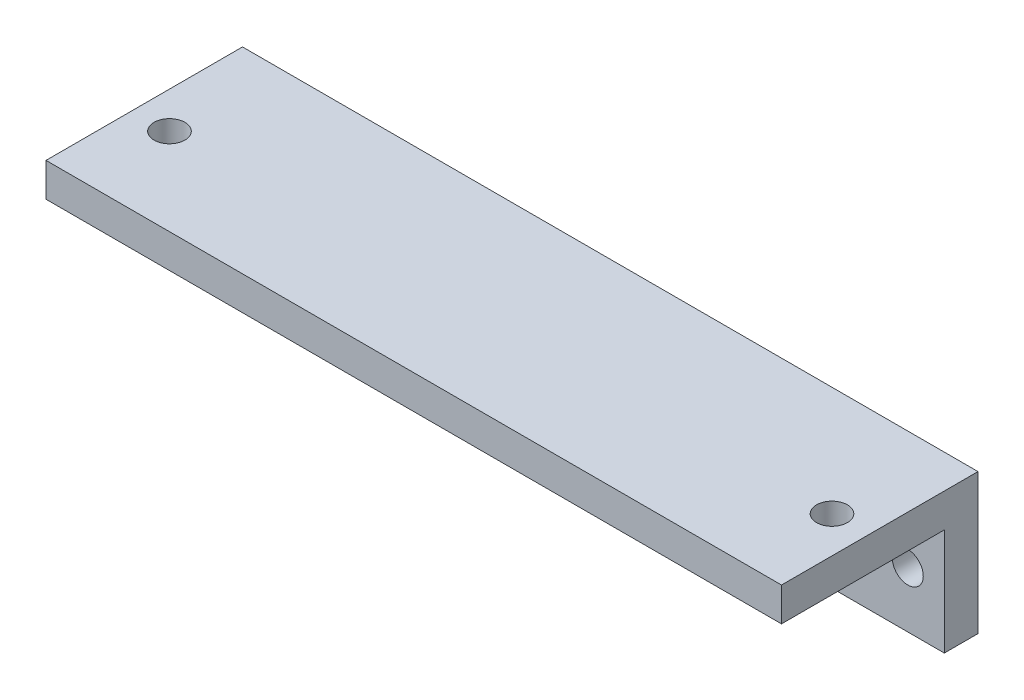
from build123d import *

# Parameters (mm, degrees)
SKETCH1_W                = 131
SKETCH1_H                = 25
EXTRUDE1_DEPTH           = 6
SKETCH2_W                = 131
SKETCH2_H                = 35
EXTRUDE2_DEPTH           = 6
M5_CLEARANCE_HOLE1_D     = 5.5
M5_CLEARANCE_HOLE1_DEPTH = 10
M5_CLEARANCE_HOLE1_TIP   = 1.652366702
M5_CLEARANCE_HOLE2_D     = 5.5
M5_CLEARANCE_HOLE2_DEPTH = 10
M5_CLEARANCE_HOLE2_TIP   = 1.652366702


with BuildPart() as part:
    # Sketch1 → Extrude1 (new body)
    with BuildSketch(Plane.XY):
        with Locations((0, -12.5)):
            Rectangle(SKETCH1_W, SKETCH1_H)
    extrude(amount=EXTRUDE1_DEPTH)

    # Sketch2 → Extrude2 (add)
    with BuildSketch(Plane(origin=(0, 0, 0), x_dir=(-1, 0, 0), z_dir=(0, 1, 0))):
        with Locations((0, 17.5)):
            Rectangle(SKETCH2_W, SKETCH2_H)
    extrude(amount=-EXTRUDE2_DEPTH)

    # M5 Clearance Hole1
    with Locations(Plane.XY.offset(6)):
        with Locations((59, -15), (-59, -15)):
            Hole(M5_CLEARANCE_HOLE1_D / 2, depth=M5_CLEARANCE_HOLE1_DEPTH)
            with Locations((0, 0, -(M5_CLEARANCE_HOLE1_DEPTH + M5_CLEARANCE_HOLE1_TIP / 2))):  # 118° drill point
                Cone(0, M5_CLEARANCE_HOLE1_D / 2, M5_CLEARANCE_HOLE1_TIP, mode=Mode.SUBTRACT)

    # M5 Clearance Hole2
    with Locations(Plane(origin=(0.415083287, -6, 44.50809769), x_dir=(1, 0, 0), z_dir=(0, -1, 0))):
        with Locations((58.584916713, -25), (-59.415083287, -25)):
            Hole(M5_CLEARANCE_HOLE2_D / 2, depth=M5_CLEARANCE_HOLE2_DEPTH)
            with Locations((0, 0, -(M5_CLEARANCE_HOLE2_DEPTH + M5_CLEARANCE_HOLE2_TIP / 2))):  # 118° drill point
                Cone(0, M5_CLEARANCE_HOLE2_D / 2, M5_CLEARANCE_HOLE2_TIP, mode=Mode.SUBTRACT)


solid = part.part
